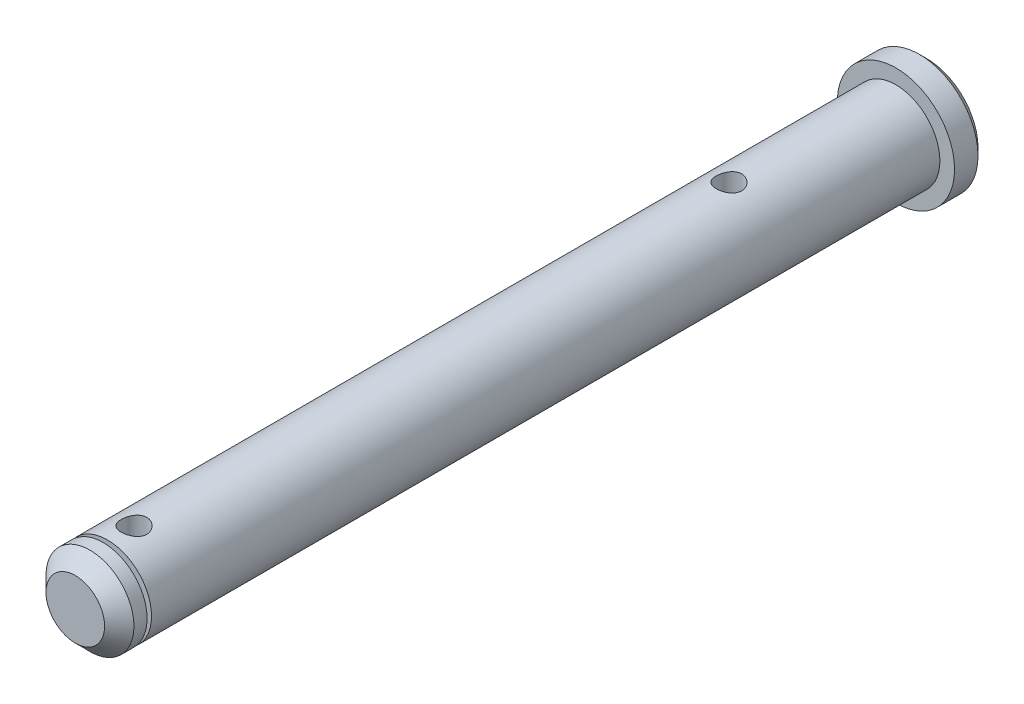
from build123d import *

# Parameters (mm, degrees)
SKETCH_1_R                = 4
EXTRUDE_1_DEPTH           = 2.1
SKETCH_2_R                = 3
EXTRUDE_2_DEPTH           = 58.1
HOLE_WIZARD_1_75_1_75_1_D = 1.75
CHAMFER_1_SIZE            = 0.5
CHAMFER_2_SIZE            = 1
SKETCH_4_W                = 0.5
SKETCH_4_H                = 0.3


with BuildPart() as part:
    # Sketch 1 → Extrude 1 (new body)
    with BuildSketch(Plane.XY):
        Circle(SKETCH_1_R)
    extrude(amount=EXTRUDE_1_DEPTH)

    # Sketch 2 → Extrude 2 (add)
    with BuildSketch(Plane(origin=(0, 0, 0), x_dir=(-1, 0, 0), z_dir=(0, 0, -1))):
        Circle(SKETCH_2_R)
    extrude(amount=-EXTRUDE_2_DEPTH)

    # Hole Wizard 1.75 _1.75_ _1 (through all)
    with Locations(Plane(origin=(0, 3, 13.5), x_dir=(0, 0, 1), z_dir=(0, 1, 0))):
        with Locations((0, 0), (40.6, 0)):
            Hole(HOLE_WIZARD_1_75_1_75_1_D / 2)

    # Chamfer 1
    chamfer_1_edges = [part.edges().sort_by_distance(p)[0] for p in [
        (-4, 0, 0),
    ]]
    chamfer(chamfer_1_edges, length=CHAMFER_1_SIZE)

    # Chamfer 2
    chamfer_2_edges = [part.edges().sort_by_distance(p)[0] for p in [
        (3, 0, 58.1),
    ]]
    chamfer(chamfer_2_edges, length=CHAMFER_2_SIZE)

    # Sketch 4 → Cut-Revolve 1 (revolve, cut)
    with BuildSketch(Plane(origin=(0, 0, 0), x_dir=(1, 0, 0), z_dir=(0, 1, 0)), mode=Mode.PRIVATE) as cut_revolve_1_sk:
        with Locations((-2.75, -56.05)):
            Rectangle(SKETCH_4_W, SKETCH_4_H)
    revolve(cut_revolve_1_sk.sketch.rotate(Axis((0, 0, 58.1), (0, 0, -1)), 180), axis=Axis((0, 0, 58.1), (0, 0, -1)), mode=Mode.SUBTRACT)


solid = part.part
